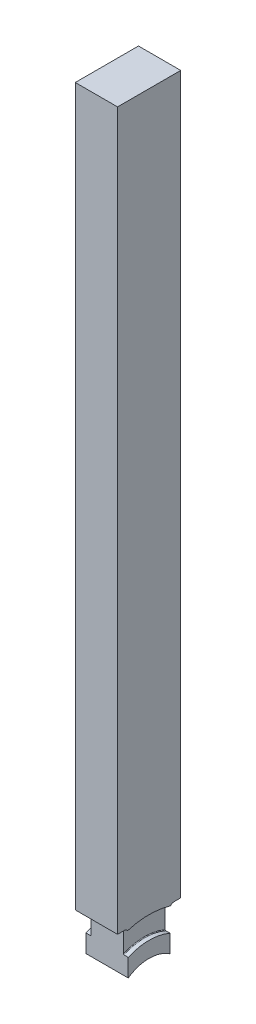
from build123d import *

# Parameters (mm, degrees)
SKETCH1_W               = 38.354
SKETCH1_H               = 479.425
BOSS_EXTRUDE1_DEPTH     = 12.827
CUT_EXTRUDE4_DEPTH      = 480.979811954
CUT_EXTRUDE4_DEPTH_BACK = 480.979811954
SKETCH8_R               = 22.225
SKETCH2_W               = 2.9718
SKETCH2_H               = 13.4874
CUT_EXTRUDE2_DEPTH      = 480.979811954
CUT_EXTRUDE2_DEPTH_BACK = 480.979811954
FILLET1_R               = 0.762
FILLET2_R               = 0.381


with BuildPart() as part:
    # Sketch1 → Boss-Extrude1 (new, symmetric)
    with BuildSketch(Plane(origin=(0, 0, 0), x_dir=(0, 0, -1), z_dir=(1, 0, 0))):
        with Locations((0, 239.7125)):
            Rectangle(SKETCH1_W, SKETCH1_H)
    extrude(amount=BOSS_EXTRUDE1_DEPTH, both=True)

    # Sketch8 → Cut-Extrude4 (cut, two sides: drawn at the far end of the back side and taken through both)
    with BuildSketch(Plane(origin=(0, 0, 0), x_dir=(0, 0, -1), z_dir=(1, 0, 0)).offset(-CUT_EXTRUDE4_DEPTH_BACK)):
        Circle(SKETCH8_R)
    extrude(amount=CUT_EXTRUDE4_DEPTH + CUT_EXTRUDE4_DEPTH_BACK, mode=Mode.SUBTRACT)

    # Sketch2 → Cut-Revolve1 (revolve, cut)
    with BuildSketch(Plane.XY):
        with Locations((11.3411, 38.4937)):
            Rectangle(SKETCH2_W, SKETCH2_H)
        with Locations((-11.3411, 38.4937)):
            Rectangle(SKETCH2_W, SKETCH2_H)
    revolve(axis=Axis((-8.84822894, 0, 0), (1, 0, 0)), mode=Mode.SUBTRACT)

    # Sketch6 → Cut-Extrude2 (cut, two sides: drawn at the far end of the back side and taken through both)
    with BuildSketch(Plane(origin=(0, 0, 0), x_dir=(0, 0, -1), z_dir=(1, 0, 0)).offset(-CUT_EXTRUDE2_DEPTH_BACK)):
        with BuildLine():
            Line((12.7, 0), (31.75, 0))
            Line((31.75, 0), (31.75, 44.4246))
            Line((31.75, 44.4246), (15.0876, 44.4246))
            ThreePointArc((15.0876, 44.4246), (13.399311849, 43.725288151), (12.7, 42.037))
            Line((12.7, 42.037), (12.7, 0))
        make_face()
        with BuildLine():
            Line((-12.7, 0), (-31.75, 0))
            Line((-31.75, 0), (-31.75, 44.4246))
            Line((-31.75, 44.4246), (-15.0876, 44.4246))
            ThreePointArc((-15.0876, 44.4246), (-13.399311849, 43.725288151), (-12.7, 42.037))
            Line((-12.7, 42.037), (-12.7, 0))
        make_face()
    extrude(amount=CUT_EXTRUDE2_DEPTH + CUT_EXTRUDE2_DEPTH_BACK, mode=Mode.SUBTRACT)

    # Fillet1
    fillet1_edges = [part.edges().sort_by_distance(p)[0] for p in [
        (9.8552, 45.2374, 0),
        (-9.8552, 45.2374, 0),
    ]]
    fillet(fillet1_edges, radius=FILLET1_R)

    # Fillet2
    fillet2_edges = [part.edges().sort_by_distance(p)[0] for p in [
        (9.8552, 31.75, 0),
        (-9.8552, 31.75, 0),
    ]]
    fillet(fillet2_edges, radius=FILLET2_R)


solid = part.part
